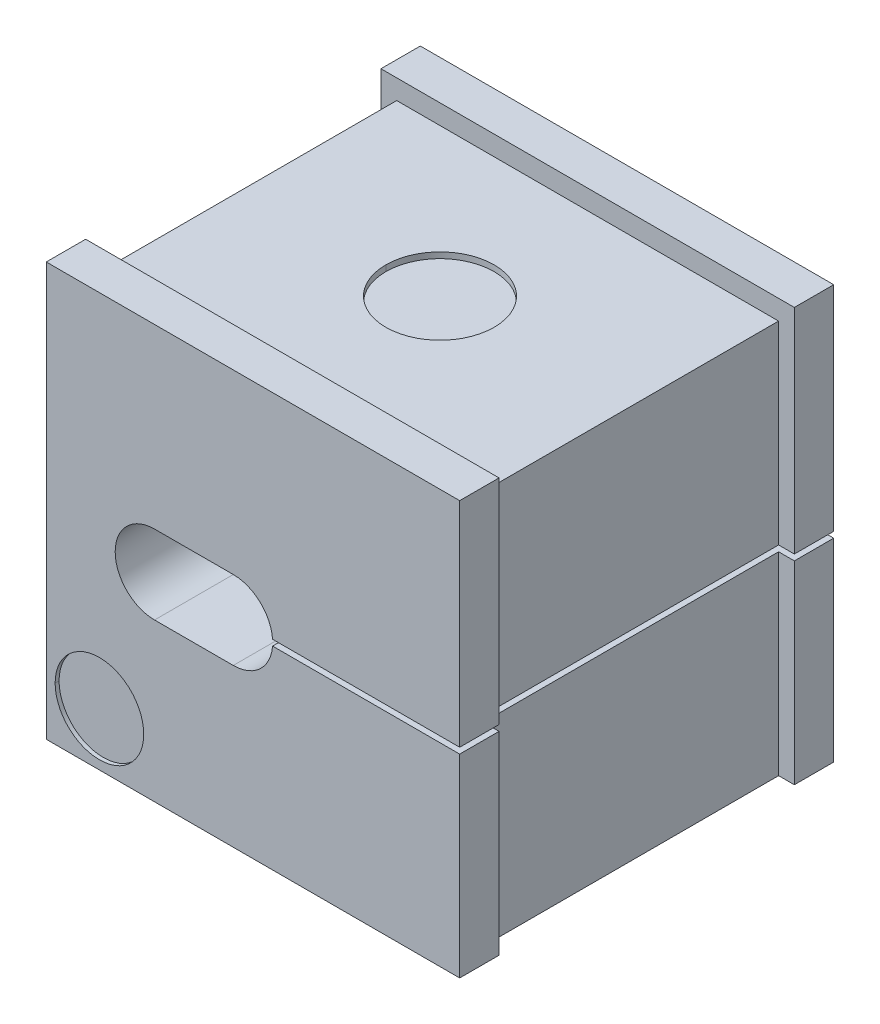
ISO-10303-21;
HEADER;
FILE_DESCRIPTION(('STEP AP214'),'2;1');
FILE_NAME('part.step','',(''),(''),'','','');
FILE_SCHEMA(('AUTOMOTIVE_DESIGN { 1 0 10303 214 1 1 1 1 }'));
ENDSEC;
DATA;
#1=APPLICATION_CONTEXT('core data for automotive mechanical design processes');
#2=APPLICATION_PROTOCOL_DEFINITION('international standard','automotive_design',2000,#1);
#3=PRODUCT_CONTEXT('',#1,'mechanical');
#4=PRODUCT('Part','Part','',(#3));
#5=PRODUCT_RELATED_PRODUCT_CATEGORY('part','',(#4));
#6=PRODUCT_DEFINITION_FORMATION('','',#4);
#7=PRODUCT_DEFINITION_CONTEXT('part definition',#1,'design');
#8=PRODUCT_DEFINITION('design','',#6,#7);
#9=PRODUCT_DEFINITION_SHAPE('','',#8);
#10=(LENGTH_UNIT() NAMED_UNIT(*) SI_UNIT(.MILLI.,.METRE.));
#11=(NAMED_UNIT(*) PLANE_ANGLE_UNIT() SI_UNIT($,.RADIAN.));
#12=(NAMED_UNIT(*) SI_UNIT($,.STERADIAN.) SOLID_ANGLE_UNIT());
#13=UNCERTAINTY_MEASURE_WITH_UNIT(LENGTH_MEASURE(1.E-05),#10,'distance_accuracy_value','');
#14=(GEOMETRIC_REPRESENTATION_CONTEXT(3) GLOBAL_UNCERTAINTY_ASSIGNED_CONTEXT((#13)) GLOBAL_UNIT_ASSIGNED_CONTEXT((#10,
#11,#12)) REPRESENTATION_CONTEXT('',''));
#15=CARTESIAN_POINT('',(0.,0.,0.));
#16=DIRECTION('',(0.,0.,1.));
#17=DIRECTION('',(1.,0.,0.));
#18=AXIS2_PLACEMENT_3D('',#15,#16,#17);
#19=CARTESIAN_POINT('',(0.,-0.35,-9.5));
#20=DIRECTION('',(0.,-1.,0.));
#21=DIRECTION('',(-1.,0.,0.));
#22=AXIS2_PLACEMENT_3D('',#19,#20,#21);
#23=PLANE('',#22);
#24=DIRECTION('',(-1.,0.,0.));
#25=VECTOR('',#24,1.);
#26=CARTESIAN_POINT('',(0.,-0.35,-7.5));
#27=LINE('',#26,#25);
#28=CARTESIAN_POINT('',(21.,-0.35,-7.5));
#29=VERTEX_POINT('',#28);
#30=CARTESIAN_POINT('',(20.2,-0.35,-7.5));
#31=VERTEX_POINT('',#30);
#32=EDGE_CURVE('E377',#29,#31,#27,.T.);
#33=ORIENTED_EDGE('',*,*,#32,.T.);
#34=DIRECTION('',(0.,0.,-1.));
#35=VECTOR('',#34,1.);
#36=CARTESIAN_POINT('',(20.2,-0.35,-5.5));
#37=LINE('',#36,#35);
#38=CARTESIAN_POINT('',(20.2,-0.35,7.5));
#39=VERTEX_POINT('',#38);
#40=EDGE_CURVE('E292',#39,#31,#37,.T.);
#41=ORIENTED_EDGE('',*,*,#40,.F.);
#42=DIRECTION('',(1.,0.,0.));
#43=VECTOR('',#42,1.);
#44=CARTESIAN_POINT('',(1.3,-0.35,7.5));
#45=LINE('',#44,#43);
#46=CARTESIAN_POINT('',(21.,-0.35,7.5));
#47=VERTEX_POINT('',#46);
#48=EDGE_CURVE('E514',#39,#47,#45,.T.);
#49=ORIENTED_EDGE('',*,*,#48,.T.);
#50=DIRECTION('',(0.,0.,1.));
#51=VECTOR('',#50,1.);
#52=CARTESIAN_POINT('',(21.,-0.35,-9.5));
#53=LINE('',#52,#51);
#54=CARTESIAN_POINT('',(21.,-0.35,9.5));
#55=VERTEX_POINT('',#54);
#56=EDGE_CURVE('E480',#47,#55,#53,.T.);
#57=ORIENTED_EDGE('',*,*,#56,.T.);
#58=DIRECTION('',(1.,0.,0.));
#59=VECTOR('',#58,1.);
#60=CARTESIAN_POINT('',(0.,-0.35,9.5));
#61=LINE('',#60,#59);
#62=CARTESIAN_POINT('',(11.4943670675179,-0.35,9.5));
#63=VERTEX_POINT('',#62);
#64=EDGE_CURVE('E322',#63,#55,#61,.T.);
#65=ORIENTED_EDGE('',*,*,#64,.F.);
#66=DIRECTION('',(0.,0.,1.));
#67=VECTOR('',#66,1.);
#68=CARTESIAN_POINT('',(11.4943670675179,-0.35,-9.5));
#69=LINE('',#68,#67);
#70=CARTESIAN_POINT('',(11.4943670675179,-0.35,-9.5));
#71=VERTEX_POINT('',#70);
#72=EDGE_CURVE('E303',#71,#63,#69,.T.);
#73=ORIENTED_EDGE('',*,*,#72,.F.);
#74=DIRECTION('',(1.,0.,0.));
#75=VECTOR('',#74,1.);
#76=CARTESIAN_POINT('',(0.,-0.35,-9.5));
#77=LINE('',#76,#75);
#78=CARTESIAN_POINT('',(21.,-0.35,-9.5));
#79=VERTEX_POINT('',#78);
#80=EDGE_CURVE('E399',#71,#79,#77,.T.);
#81=ORIENTED_EDGE('',*,*,#80,.T.);
#82=DIRECTION('',(0.,0.,1.));
#83=VECTOR('',#82,1.);
#84=CARTESIAN_POINT('',(21.,-0.35,-9.5));
#85=LINE('',#84,#83);
#86=EDGE_CURVE('E469',#79,#29,#85,.T.);
#87=ORIENTED_EDGE('',*,*,#86,.T.);
#88=EDGE_LOOP('',(#33,#41,#49,#57,#65,#73,#81,#87));
#89=FACE_BOUND('',#88,.T.);
#90=ADVANCED_FACE('F15',(#89),#23,.T.);
#91=CARTESIAN_POINT('',(0.,-0.65,-9.5));
#92=DIRECTION('',(0.,-1.,0.));
#93=DIRECTION('',(-1.,0.,0.));
#94=AXIS2_PLACEMENT_3D('',#91,#92,#93);
#95=PLANE('',#94);
#96=DIRECTION('',(0.,0.,1.));
#97=VECTOR('',#96,1.);
#98=CARTESIAN_POINT('',(21.,-0.65,-9.5));
#99=LINE('',#98,#97);
#100=CARTESIAN_POINT('',(21.,-0.65,-9.5));
#101=VERTEX_POINT('',#100);
#102=CARTESIAN_POINT('',(21.,-0.65,-7.5));
#103=VERTEX_POINT('',#102);
#104=EDGE_CURVE('E555',#101,#103,#99,.T.);
#105=ORIENTED_EDGE('',*,*,#104,.F.);
#106=DIRECTION('',(1.,0.,0.));
#107=VECTOR('',#106,1.);
#108=CARTESIAN_POINT('',(0.,-0.65,-9.5));
#109=LINE('',#108,#107);
#110=CARTESIAN_POINT('',(11.4943670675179,-0.65,-9.5));
#111=VERTEX_POINT('',#110);
#112=EDGE_CURVE('E427',#111,#101,#109,.T.);
#113=ORIENTED_EDGE('',*,*,#112,.F.);
#114=DIRECTION('',(0.,0.,1.));
#115=VECTOR('',#114,1.);
#116=CARTESIAN_POINT('',(11.4943670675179,-0.65,-9.5));
#117=LINE('',#116,#115);
#118=CARTESIAN_POINT('',(11.4943670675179,-0.65,9.5));
#119=VERTEX_POINT('',#118);
#120=EDGE_CURVE('E270',#111,#119,#117,.T.);
#121=ORIENTED_EDGE('',*,*,#120,.T.);
#122=DIRECTION('',(1.,0.,0.));
#123=VECTOR('',#122,1.);
#124=CARTESIAN_POINT('',(0.,-0.65,9.5));
#125=LINE('',#124,#123);
#126=CARTESIAN_POINT('',(21.,-0.65,9.5));
#127=VERTEX_POINT('',#126);
#128=EDGE_CURVE('E311',#119,#127,#125,.T.);
#129=ORIENTED_EDGE('',*,*,#128,.T.);
#130=DIRECTION('',(0.,0.,1.));
#131=VECTOR('',#130,1.);
#132=CARTESIAN_POINT('',(21.,-0.65,-9.5));
#133=LINE('',#132,#131);
#134=CARTESIAN_POINT('',(21.,-0.65,7.5));
#135=VERTEX_POINT('',#134);
#136=EDGE_CURVE('E493',#135,#127,#133,.T.);
#137=ORIENTED_EDGE('',*,*,#136,.F.);
#138=DIRECTION('',(1.,0.,0.));
#139=VECTOR('',#138,1.);
#140=CARTESIAN_POINT('',(1.3,-0.65,7.5));
#141=LINE('',#140,#139);
#142=CARTESIAN_POINT('',(20.2,-0.65,7.5));
#143=VERTEX_POINT('',#142);
#144=EDGE_CURVE('E36',#143,#135,#141,.T.);
#145=ORIENTED_EDGE('',*,*,#144,.F.);
#146=DIRECTION('',(0.,0.,-1.));
#147=VECTOR('',#146,1.);
#148=CARTESIAN_POINT('',(20.2,-0.65,-5.5));
#149=LINE('',#148,#147);
#150=CARTESIAN_POINT('',(20.2,-0.65,-7.5));
#151=VERTEX_POINT('',#150);
#152=EDGE_CURVE('E439',#143,#151,#149,.T.);
#153=ORIENTED_EDGE('',*,*,#152,.T.);
#154=DIRECTION('',(-1.,0.,0.));
#155=VECTOR('',#154,1.);
#156=CARTESIAN_POINT('',(0.,-0.65,-7.5));
#157=LINE('',#156,#155);
#158=EDGE_CURVE('E46',#103,#151,#157,.T.);
#159=ORIENTED_EDGE('',*,*,#158,.F.);
#160=EDGE_LOOP('',(#105,#113,#121,#129,#137,#145,#153,#159));
#161=FACE_BOUND('',#160,.T.);
#162=ADVANCED_FACE('F573',(#161),#95,.F.);
#163=CARTESIAN_POINT('',(9.5,1.5,-9.5));
#164=DIRECTION('',(0.,-1.,0.));
#165=DIRECTION('',(0.,0.,-1.));
#166=AXIS2_PLACEMENT_3D('',#163,#164,#165);
#167=PLANE('',#166);
#168=DIRECTION('',(1.,0.,0.));
#169=VECTOR('',#168,1.);
#170=CARTESIAN_POINT('',(9.5,1.5,9.5));
#171=LINE('',#170,#169);
#172=CARTESIAN_POINT('',(5.5,1.5,9.5));
#173=VERTEX_POINT('',#172);
#174=CARTESIAN_POINT('',(9.5,1.5,9.5));
#175=VERTEX_POINT('',#174);
#176=EDGE_CURVE('E385',#173,#175,#171,.T.);
#177=ORIENTED_EDGE('',*,*,#176,.F.);
#178=DIRECTION('',(0.,0.,1.));
#179=VECTOR('',#178,1.);
#180=CARTESIAN_POINT('',(5.5,1.5,-9.5));
#181=LINE('',#180,#179);
#182=CARTESIAN_POINT('',(5.5,1.5,-9.5));
#183=VERTEX_POINT('',#182);
#184=EDGE_CURVE('E9',#183,#173,#181,.T.);
#185=ORIENTED_EDGE('',*,*,#184,.F.);
#186=DIRECTION('',(1.,0.,0.));
#187=VECTOR('',#186,1.);
#188=CARTESIAN_POINT('',(9.5,1.5,-9.5));
#189=LINE('',#188,#187);
#190=CARTESIAN_POINT('',(9.5,1.5,-9.5));
#191=VERTEX_POINT('',#190);
#192=EDGE_CURVE('E409',#183,#191,#189,.T.);
#193=ORIENTED_EDGE('',*,*,#192,.T.);
#194=DIRECTION('',(0.,0.,1.));
#195=VECTOR('',#194,1.);
#196=CARTESIAN_POINT('',(9.5,1.5,-9.5));
#197=LINE('',#196,#195);
#198=EDGE_CURVE('E306',#191,#175,#197,.T.);
#199=ORIENTED_EDGE('',*,*,#198,.T.);
#200=EDGE_LOOP('',(#177,#185,#193,#199));
#201=FACE_BOUND('',#200,.T.);
#202=ADVANCED_FACE('F641',(#201),#167,.T.);
#203=CARTESIAN_POINT('',(5.5,-0.5,-9.5));
#204=DIRECTION('',(0.,0.,1.));
#205=DIRECTION('',(1.,0.,0.));
#206=AXIS2_PLACEMENT_3D('',#203,#204,#205);
#207=CYLINDRICAL_SURFACE('',#206,2.);
#208=CARTESIAN_POINT('',(5.5,-0.5,9.5));
#209=DIRECTION('',(0.,0.,-1.));
#210=DIRECTION('',(-1.,0.,0.));
#211=AXIS2_PLACEMENT_3D('',#208,#209,#210);
#212=CIRCLE('',#211,2.);
#213=CARTESIAN_POINT('',(5.5,-2.5,9.5));
#214=VERTEX_POINT('',#213);
#215=EDGE_CURVE('E376',#214,#173,#212,.T.);
#216=ORIENTED_EDGE('',*,*,#215,.F.);
#217=DIRECTION('',(0.,0.,1.));
#218=VECTOR('',#217,1.);
#219=CARTESIAN_POINT('',(5.5,-2.5,-9.5));
#220=LINE('',#219,#218);
#221=CARTESIAN_POINT('',(5.5,-2.5,-9.5));
#222=VERTEX_POINT('',#221);
#223=EDGE_CURVE('E24',#222,#214,#220,.T.);
#224=ORIENTED_EDGE('',*,*,#223,.F.);
#225=CARTESIAN_POINT('',(5.5,-0.5,-9.5));
#226=DIRECTION('',(0.,0.,-1.));
#227=DIRECTION('',(-1.,0.,0.));
#228=AXIS2_PLACEMENT_3D('',#225,#226,#227);
#229=CIRCLE('',#228,2.);
#230=EDGE_CURVE('E413',#222,#183,#229,.T.);
#231=ORIENTED_EDGE('',*,*,#230,.T.);
#232=ORIENTED_EDGE('',*,*,#184,.T.);
#233=EDGE_LOOP('',(#216,#224,#231,#232));
#234=FACE_BOUND('',#233,.T.);
#235=ADVANCED_FACE('F644',(#234),#207,.F.);
#236=CARTESIAN_POINT('',(9.5,-2.5,-9.5));
#237=DIRECTION('',(0.,1.,0.));
#238=DIRECTION('',(1.,0.,0.));
#239=AXIS2_PLACEMENT_3D('',#236,#237,#238);
#240=PLANE('',#239);
#241=DIRECTION('',(-1.,0.,0.));
#242=VECTOR('',#241,1.);
#243=CARTESIAN_POINT('',(9.5,-2.5,9.5));
#244=LINE('',#243,#242);
#245=CARTESIAN_POINT('',(9.5,-2.5,9.5));
#246=VERTEX_POINT('',#245);
#247=EDGE_CURVE('E369',#246,#214,#244,.T.);
#248=ORIENTED_EDGE('',*,*,#247,.F.);
#249=DIRECTION('',(0.,0.,1.));
#250=VECTOR('',#249,1.);
#251=CARTESIAN_POINT('',(9.5,-2.5,-9.5));
#252=LINE('',#251,#250);
#253=CARTESIAN_POINT('',(9.5,-2.5,-9.5));
#254=VERTEX_POINT('',#253);
#255=EDGE_CURVE('E18',#254,#246,#252,.T.);
#256=ORIENTED_EDGE('',*,*,#255,.F.);
#257=DIRECTION('',(-1.,0.,0.));
#258=VECTOR('',#257,1.);
#259=CARTESIAN_POINT('',(9.5,-2.5,-9.5));
#260=LINE('',#259,#258);
#261=EDGE_CURVE('E419',#254,#222,#260,.T.);
#262=ORIENTED_EDGE('',*,*,#261,.T.);
#263=ORIENTED_EDGE('',*,*,#223,.T.);
#264=EDGE_LOOP('',(#248,#256,#262,#263));
#265=FACE_BOUND('',#264,.T.);
#266=ADVANCED_FACE('F646',(#265),#240,.T.);
#267=CARTESIAN_POINT('',(9.5,-0.5,-9.5));
#268=DIRECTION('',(0.,0.,1.));
#269=DIRECTION('',(1.,0.,0.));
#270=AXIS2_PLACEMENT_3D('',#267,#268,#269);
#271=CYLINDRICAL_SURFACE('',#270,2.);
#272=ORIENTED_EDGE('',*,*,#120,.F.);
#273=CARTESIAN_POINT('',(9.5,-0.5,-9.5));
#274=DIRECTION('',(0.,0.,-1.));
#275=DIRECTION('',(-1.,0.,0.));
#276=AXIS2_PLACEMENT_3D('',#273,#274,#275);
#277=CIRCLE('',#276,2.);
#278=EDGE_CURVE('E423',#111,#254,#277,.T.);
#279=ORIENTED_EDGE('',*,*,#278,.T.);
#280=ORIENTED_EDGE('',*,*,#255,.T.);
#281=CARTESIAN_POINT('',(9.5,-0.5,9.5));
#282=DIRECTION('',(0.,0.,-1.));
#283=DIRECTION('',(-1.,0.,0.));
#284=AXIS2_PLACEMENT_3D('',#281,#282,#283);
#285=CIRCLE('',#284,2.);
#286=EDGE_CURVE('E328',#119,#246,#285,.T.);
#287=ORIENTED_EDGE('',*,*,#286,.F.);
#288=EDGE_LOOP('',(#272,#279,#280,#287));
#289=FACE_BOUND('',#288,.T.);
#290=ADVANCED_FACE('F592',(#289),#271,.F.);
#291=CARTESIAN_POINT('',(2.7,-7.8,9.3));
#292=DIRECTION('',(0.,0.,1.));
#293=DIRECTION('',(1.,0.,0.));
#294=AXIS2_PLACEMENT_3D('',#291,#292,#293);
#295=PLANE('',#294);
#296=CARTESIAN_POINT('',(2.7,-7.8,9.3));
#297=DIRECTION('',(0.,0.,1.));
#298=DIRECTION('',(1.,0.,0.));
#299=AXIS2_PLACEMENT_3D('',#296,#297,#298);
#300=CIRCLE('',#299,2.25);
#301=CARTESIAN_POINT('',(4.95,-7.8,9.3));
#302=VERTEX_POINT('',#301);
#303=CARTESIAN_POINT('',(0.45,-7.8,9.3));
#304=VERTEX_POINT('',#303);
#305=EDGE_CURVE('E261',#302,#304,#300,.T.);
#306=ORIENTED_EDGE('',*,*,#305,.T.);
#307=CARTESIAN_POINT('',(2.7,-7.8,9.3));
#308=DIRECTION('',(0.,0.,1.));
#309=DIRECTION('',(1.,0.,0.));
#310=AXIS2_PLACEMENT_3D('',#307,#308,#309);
#311=CIRCLE('',#310,2.25);
#312=EDGE_CURVE('E265',#304,#302,#311,.T.);
#313=ORIENTED_EDGE('',*,*,#312,.T.);
#314=EDGE_LOOP('',(#306,#313));
#315=FACE_BOUND('',#314,.T.);
#316=ADVANCED_FACE('F263',(#315),#295,.T.);
#317=CARTESIAN_POINT('',(2.7,-7.8,9.3));
#318=DIRECTION('',(0.,0.,1.));
#319=DIRECTION('',(1.,0.,0.));
#320=AXIS2_PLACEMENT_3D('',#317,#318,#319);
#321=CYLINDRICAL_SURFACE('',#320,2.25);
#322=DIRECTION('',(0.,0.,1.));
#323=VECTOR('',#322,1.);
#324=CARTESIAN_POINT('',(0.45,-7.8,9.3));
#325=LINE('',#324,#323);
#326=CARTESIAN_POINT('',(0.45,-7.8,9.5));
#327=VERTEX_POINT('',#326);
#328=EDGE_CURVE('E274',#304,#327,#325,.T.);
#329=ORIENTED_EDGE('',*,*,#328,.F.);
#330=ORIENTED_EDGE('',*,*,#305,.F.);
#331=DIRECTION('',(0.,0.,1.));
#332=VECTOR('',#331,1.);
#333=CARTESIAN_POINT('',(4.95,-7.8,9.3));
#334=LINE('',#333,#332);
#335=CARTESIAN_POINT('',(4.95,-7.8,9.5));
#336=VERTEX_POINT('',#335);
#337=EDGE_CURVE('E284',#302,#336,#334,.T.);
#338=ORIENTED_EDGE('',*,*,#337,.T.);
#339=CARTESIAN_POINT('',(2.7,-7.8,9.5));
#340=DIRECTION('',(0.,0.,1.));
#341=DIRECTION('',(1.,0.,0.));
#342=AXIS2_PLACEMENT_3D('',#339,#340,#341);
#343=CIRCLE('',#342,2.25);
#344=EDGE_CURVE('E276',#336,#327,#343,.T.);
#345=ORIENTED_EDGE('',*,*,#344,.T.);
#346=EDGE_LOOP('',(#329,#330,#338,#345));
#347=FACE_BOUND('',#346,.T.);
#348=ADVANCED_FACE('F275',(#347),#321,.F.);
#349=CARTESIAN_POINT('',(10.5,9.2,0.));
#350=DIRECTION('',(0.,1.,0.));
#351=DIRECTION('',(-1.,0.,0.));
#352=AXIS2_PLACEMENT_3D('',#349,#350,#351);
#353=CYLINDRICAL_SURFACE('',#352,2.75);
#354=DIRECTION('',(0.,1.,0.));
#355=VECTOR('',#354,1.);
#356=CARTESIAN_POINT('',(13.25,9.2,0.));
#357=LINE('',#356,#355);
#358=CARTESIAN_POINT('',(13.25,9.2,0.));
#359=VERTEX_POINT('',#358);
#360=CARTESIAN_POINT('',(13.25,9.5,0.));
#361=VERTEX_POINT('',#360);
#362=EDGE_CURVE('E344',#359,#361,#357,.T.);
#363=ORIENTED_EDGE('',*,*,#362,.F.);
#364=CARTESIAN_POINT('',(10.5,9.2,0.));
#365=DIRECTION('',(0.,1.,0.));
#366=DIRECTION('',(-1.,0.,0.));
#367=AXIS2_PLACEMENT_3D('',#364,#365,#366);
#368=CIRCLE('',#367,2.75);
#369=CARTESIAN_POINT('',(7.75,9.2,0.));
#370=VERTEX_POINT('',#369);
#371=EDGE_CURVE('E271',#370,#359,#368,.T.);
#372=ORIENTED_EDGE('',*,*,#371,.F.);
#373=DIRECTION('',(0.,1.,0.));
#374=VECTOR('',#373,1.);
#375=CARTESIAN_POINT('',(7.75,9.2,0.));
#376=LINE('',#375,#374);
#377=CARTESIAN_POINT('',(7.75,9.5,0.));
#378=VERTEX_POINT('',#377);
#379=EDGE_CURVE('E357',#370,#378,#376,.T.);
#380=ORIENTED_EDGE('',*,*,#379,.T.);
#381=CARTESIAN_POINT('',(10.5,9.5,0.));
#382=DIRECTION('',(0.,-1.,0.));
#383=DIRECTION('',(1.,0.,0.));
#384=AXIS2_PLACEMENT_3D('',#381,#382,#383);
#385=CIRCLE('',#384,2.75);
#386=EDGE_CURVE('E298',#361,#378,#385,.T.);
#387=ORIENTED_EDGE('',*,*,#386,.F.);
#388=EDGE_LOOP('',(#363,#372,#380,#387));
#389=FACE_BOUND('',#388,.T.);
#390=ADVANCED_FACE('F793',(#389),#353,.F.);
#391=CARTESIAN_POINT('',(10.5,9.2,0.));
#392=DIRECTION('',(0.,1.,0.));
#393=DIRECTION('',(1.,0.,0.));
#394=AXIS2_PLACEMENT_3D('',#391,#392,#393);
#395=PLANE('',#394);
#396=ORIENTED_EDGE('',*,*,#371,.T.);
#397=CARTESIAN_POINT('',(10.5,9.2,0.));
#398=DIRECTION('',(0.,1.,0.));
#399=DIRECTION('',(-1.,0.,0.));
#400=AXIS2_PLACEMENT_3D('',#397,#398,#399);
#401=CIRCLE('',#400,2.75);
#402=EDGE_CURVE('E334',#359,#370,#401,.T.);
#403=ORIENTED_EDGE('',*,*,#402,.T.);
#404=EDGE_LOOP('',(#396,#403));
#405=FACE_BOUND('',#404,.T.);
#406=ADVANCED_FACE('F788',(#405),#395,.T.);
#407=CARTESIAN_POINT('',(1.3,0.,7.5));
#408=DIRECTION('',(0.,0.,1.));
#409=DIRECTION('',(1.,0.,0.));
#410=AXIS2_PLACEMENT_3D('',#407,#408,#409);
#411=PLANE('',#410);
#412=DIRECTION('',(0.,-1.,0.));
#413=VECTOR('',#412,1.);
#414=CARTESIAN_POINT('',(20.2,9.5,7.5));
#415=LINE('',#414,#413);
#416=CARTESIAN_POINT('',(20.2,-10.5,7.5));
#417=VERTEX_POINT('',#416);
#418=EDGE_CURVE('E442',#143,#417,#415,.T.);
#419=ORIENTED_EDGE('',*,*,#418,.F.);
#420=ORIENTED_EDGE('',*,*,#144,.T.);
#421=DIRECTION('',(0.,1.,0.));
#422=VECTOR('',#421,1.);
#423=CARTESIAN_POINT('',(21.,-10.5,7.5));
#424=LINE('',#423,#422);
#425=CARTESIAN_POINT('',(21.,-10.5,7.5));
#426=VERTEX_POINT('',#425);
#427=EDGE_CURVE('E490',#426,#135,#424,.T.);
#428=ORIENTED_EDGE('',*,*,#427,.F.);
#429=DIRECTION('',(-1.,0.,0.));
#430=VECTOR('',#429,1.);
#431=CARTESIAN_POINT('',(19.7,-10.5,7.5));
#432=LINE('',#431,#430);
#433=EDGE_CURVE('E345',#426,#417,#432,.T.);
#434=ORIENTED_EDGE('',*,*,#433,.T.);
#435=EDGE_LOOP('',(#419,#420,#428,#434));
#436=FACE_BOUND('',#435,.T.);
#437=ADVANCED_FACE('F575',(#436),#411,.F.);
#438=CARTESIAN_POINT('',(0.,0.,-7.5));
#439=DIRECTION('',(0.,0.,-1.));
#440=DIRECTION('',(-1.,0.,0.));
#441=AXIS2_PLACEMENT_3D('',#438,#439,#440);
#442=PLANE('',#441);
#443=DIRECTION('',(0.,1.,0.));
#444=VECTOR('',#443,1.);
#445=CARTESIAN_POINT('',(21.,-10.5,-7.5));
#446=LINE('',#445,#444);
#447=CARTESIAN_POINT('',(21.,-10.5,-7.5));
#448=VERTEX_POINT('',#447);
#449=EDGE_CURVE('E559',#448,#103,#446,.T.);
#450=ORIENTED_EDGE('',*,*,#449,.T.);
#451=ORIENTED_EDGE('',*,*,#158,.T.);
#452=DIRECTION('',(0.,1.,0.));
#453=VECTOR('',#452,1.);
#454=CARTESIAN_POINT('',(20.2,9.5,-7.5));
#455=LINE('',#454,#453);
#456=CARTESIAN_POINT('',(20.2,-10.5,-7.5));
#457=VERTEX_POINT('',#456);
#458=EDGE_CURVE('E451',#457,#151,#455,.T.);
#459=ORIENTED_EDGE('',*,*,#458,.F.);
#460=DIRECTION('',(1.,0.,0.));
#461=VECTOR('',#460,1.);
#462=CARTESIAN_POINT('',(21.,-10.5,-7.5));
#463=LINE('',#462,#461);
#464=EDGE_CURVE('E349',#457,#448,#463,.T.);
#465=ORIENTED_EDGE('',*,*,#464,.T.);
#466=EDGE_LOOP('',(#450,#451,#459,#465));
#467=FACE_BOUND('',#466,.T.);
#468=ADVANCED_FACE('F568',(#467),#442,.F.);
#469=CARTESIAN_POINT('',(0.8,0.,1.75));
#470=DIRECTION('',(1.,0.,0.));
#471=DIRECTION('',(0.,0.,-1.));
#472=AXIS2_PLACEMENT_3D('',#469,#470,#471);
#473=PLANE('',#472);
#474=DIRECTION('',(0.,0.,-1.));
#475=VECTOR('',#474,1.);
#476=CARTESIAN_POINT('',(0.8,-10.5,1.75));
#477=LINE('',#476,#475);
#478=CARTESIAN_POINT('',(0.8,-10.5,7.5));
#479=VERTEX_POINT('',#478);
#480=CARTESIAN_POINT('',(0.8,-10.5,-7.5));
#481=VERTEX_POINT('',#480);
#482=EDGE_CURVE('E316',#479,#481,#477,.T.);
#483=ORIENTED_EDGE('',*,*,#482,.F.);
#484=DIRECTION('',(0.,1.,0.));
#485=VECTOR('',#484,1.);
#486=CARTESIAN_POINT('',(0.8,9.5,7.5));
#487=LINE('',#486,#485);
#488=CARTESIAN_POINT('',(0.8,9.5,7.5));
#489=VERTEX_POINT('',#488);
#490=EDGE_CURVE('E521',#479,#489,#487,.T.);
#491=ORIENTED_EDGE('',*,*,#490,.T.);
#492=DIRECTION('',(0.,0.,-1.));
#493=VECTOR('',#492,1.);
#494=CARTESIAN_POINT('',(0.8,9.5,1.75));
#495=LINE('',#494,#493);
#496=CARTESIAN_POINT('',(0.8,9.5,-7.5));
#497=VERTEX_POINT('',#496);
#498=EDGE_CURVE('E301',#489,#497,#495,.T.);
#499=ORIENTED_EDGE('',*,*,#498,.T.);
#500=DIRECTION('',(0.,-1.,0.));
#501=VECTOR('',#500,1.);
#502=CARTESIAN_POINT('',(0.8,9.5,-7.5));
#503=LINE('',#502,#501);
#504=EDGE_CURVE('E505',#497,#481,#503,.T.);
#505=ORIENTED_EDGE('',*,*,#504,.T.);
#506=EDGE_LOOP('',(#483,#491,#499,#505));
#507=FACE_BOUND('',#506,.T.);
#508=ADVANCED_FACE('F617',(#507),#473,.F.);
#509=CARTESIAN_POINT('',(0.,0.,9.5));
#510=DIRECTION('',(1.,0.,0.));
#511=DIRECTION('',(0.,1.,0.));
#512=AXIS2_PLACEMENT_3D('',#509,#510,#511);
#513=PLANE('',#512);
#514=DIRECTION('',(0.,0.,-1.));
#515=VECTOR('',#514,1.);
#516=CARTESIAN_POINT('',(0.,-10.5,9.5));
#517=LINE('',#516,#515);
#518=CARTESIAN_POINT('',(0.,-10.5,-7.5));
#519=VERTEX_POINT('',#518);
#520=CARTESIAN_POINT('',(0.,-10.5,-9.5));
#521=VERTEX_POINT('',#520);
#522=EDGE_CURVE('E312',#519,#521,#517,.T.);
#523=ORIENTED_EDGE('',*,*,#522,.F.);
#524=DIRECTION('',(0.,1.,0.));
#525=VECTOR('',#524,1.);
#526=CARTESIAN_POINT('',(0.,0.,-7.5));
#527=LINE('',#526,#525);
#528=CARTESIAN_POINT('',(0.,10.5,-7.5));
#529=VERTEX_POINT('',#528);
#530=EDGE_CURVE('E497',#519,#529,#527,.T.);
#531=ORIENTED_EDGE('',*,*,#530,.T.);
#532=DIRECTION('',(0.,0.,-1.));
#533=VECTOR('',#532,1.);
#534=CARTESIAN_POINT('',(0.,10.5,9.5));
#535=LINE('',#534,#533);
#536=CARTESIAN_POINT('',(0.,10.5,-9.5));
#537=VERTEX_POINT('',#536);
#538=EDGE_CURVE('E443',#529,#537,#535,.T.);
#539=ORIENTED_EDGE('',*,*,#538,.T.);
#540=DIRECTION('',(0.,-1.,0.));
#541=VECTOR('',#540,1.);
#542=CARTESIAN_POINT('',(0.,0.,-9.5));
#543=LINE('',#542,#541);
#544=EDGE_CURVE('E340',#537,#521,#543,.T.);
#545=ORIENTED_EDGE('',*,*,#544,.T.);
#546=EDGE_LOOP('',(#523,#531,#539,#545));
#547=FACE_BOUND('',#546,.T.);
#548=ADVANCED_FACE('F622',(#547),#513,.F.);
#549=CARTESIAN_POINT('',(0.,0.,9.5));
#550=DIRECTION('',(1.,0.,0.));
#551=DIRECTION('',(0.,1.,0.));
#552=AXIS2_PLACEMENT_3D('',#549,#550,#551);
#553=PLANE('',#552);
#554=DIRECTION('',(0.,1.,0.));
#555=VECTOR('',#554,1.);
#556=CARTESIAN_POINT('',(0.,0.,7.5));
#557=LINE('',#556,#555);
#558=CARTESIAN_POINT('',(0.,-10.5,7.5));
#559=VERTEX_POINT('',#558);
#560=CARTESIAN_POINT('',(0.,10.5,7.5));
#561=VERTEX_POINT('',#560);
#562=EDGE_CURVE('E530',#559,#561,#557,.T.);
#563=ORIENTED_EDGE('',*,*,#562,.F.);
#564=DIRECTION('',(0.,0.,-1.));
#565=VECTOR('',#564,1.);
#566=CARTESIAN_POINT('',(0.,-10.5,9.5));
#567=LINE('',#566,#565);
#568=CARTESIAN_POINT('',(0.,-10.5,9.5));
#569=VERTEX_POINT('',#568);
#570=EDGE_CURVE('E477',#569,#559,#567,.T.);
#571=ORIENTED_EDGE('',*,*,#570,.F.);
#572=DIRECTION('',(0.,-1.,0.));
#573=VECTOR('',#572,1.);
#574=CARTESIAN_POINT('',(0.,0.,9.5));
#575=LINE('',#574,#573);
#576=CARTESIAN_POINT('',(0.,10.5,9.5));
#577=VERTEX_POINT('',#576);
#578=EDGE_CURVE('E297',#577,#569,#575,.T.);
#579=ORIENTED_EDGE('',*,*,#578,.F.);
#580=DIRECTION('',(0.,0.,-1.));
#581=VECTOR('',#580,1.);
#582=CARTESIAN_POINT('',(0.,10.5,9.5));
#583=LINE('',#582,#581);
#584=EDGE_CURVE('E300',#577,#561,#583,.T.);
#585=ORIENTED_EDGE('',*,*,#584,.T.);
#586=EDGE_LOOP('',(#563,#571,#579,#585));
#587=FACE_BOUND('',#586,.T.);
#588=ADVANCED_FACE('F606',(#587),#553,.F.);
#589=CARTESIAN_POINT('',(21.,0.,9.5));
#590=DIRECTION('',(1.,0.,0.));
#591=DIRECTION('',(0.,1.,0.));
#592=AXIS2_PLACEMENT_3D('',#589,#590,#591);
#593=PLANE('',#592);
#594=ORIENTED_EDGE('',*,*,#136,.T.);
#595=DIRECTION('',(0.,-1.,0.));
#596=VECTOR('',#595,1.);
#597=CARTESIAN_POINT('',(21.,0.,9.5));
#598=LINE('',#597,#596);
#599=CARTESIAN_POINT('',(21.,-10.5,9.5));
#600=VERTEX_POINT('',#599);
#601=EDGE_CURVE('E296',#127,#600,#598,.T.);
#602=ORIENTED_EDGE('',*,*,#601,.T.);
#603=DIRECTION('',(0.,0.,-1.));
#604=VECTOR('',#603,1.);
#605=CARTESIAN_POINT('',(21.,-10.5,9.5));
#606=LINE('',#605,#604);
#607=EDGE_CURVE('E348',#600,#426,#606,.T.);
#608=ORIENTED_EDGE('',*,*,#607,.T.);
#609=ORIENTED_EDGE('',*,*,#427,.T.);
#610=EDGE_LOOP('',(#594,#602,#608,#609));
#611=FACE_BOUND('',#610,.T.);
#612=ADVANCED_FACE('F600',(#611),#593,.T.);
#613=CARTESIAN_POINT('',(21.,0.,9.5));
#614=DIRECTION('',(1.,0.,0.));
#615=DIRECTION('',(0.,1.,0.));
#616=AXIS2_PLACEMENT_3D('',#613,#614,#615);
#617=PLANE('',#616);
#618=ORIENTED_EDGE('',*,*,#104,.T.);
#619=ORIENTED_EDGE('',*,*,#449,.F.);
#620=DIRECTION('',(0.,0.,-1.));
#621=VECTOR('',#620,1.);
#622=CARTESIAN_POINT('',(21.,-10.5,9.5));
#623=LINE('',#622,#621);
#624=CARTESIAN_POINT('',(21.,-10.5,-9.5));
#625=VERTEX_POINT('',#624);
#626=EDGE_CURVE('E315',#448,#625,#623,.T.);
#627=ORIENTED_EDGE('',*,*,#626,.T.);
#628=DIRECTION('',(0.,-1.,0.));
#629=VECTOR('',#628,1.);
#630=CARTESIAN_POINT('',(21.,0.,-9.5));
#631=LINE('',#630,#629);
#632=EDGE_CURVE('E431',#101,#625,#631,.T.);
#633=ORIENTED_EDGE('',*,*,#632,.F.);
#634=EDGE_LOOP('',(#618,#619,#627,#633));
#635=FACE_BOUND('',#634,.T.);
#636=ADVANCED_FACE('F583',(#635),#617,.T.);
#637=CARTESIAN_POINT('',(0.,-10.5,9.5));
#638=DIRECTION('',(0.,-1.,0.));
#639=DIRECTION('',(0.,0.,-1.));
#640=AXIS2_PLACEMENT_3D('',#637,#638,#639);
#641=PLANE('',#640);
#642=ORIENTED_EDGE('',*,*,#482,.T.);
#643=DIRECTION('',(-1.,0.,0.));
#644=VECTOR('',#643,1.);
#645=CARTESIAN_POINT('',(0.,-10.5,-7.5));
#646=LINE('',#645,#644);
#647=EDGE_CURVE('E501',#481,#519,#646,.T.);
#648=ORIENTED_EDGE('',*,*,#647,.T.);
#649=ORIENTED_EDGE('',*,*,#522,.T.);
#650=DIRECTION('',(-1.,0.,0.));
#651=VECTOR('',#650,1.);
#652=CARTESIAN_POINT('',(0.,-10.5,-9.5));
#653=LINE('',#652,#651);
#654=EDGE_CURVE('E435',#625,#521,#653,.T.);
#655=ORIENTED_EDGE('',*,*,#654,.F.);
#656=ORIENTED_EDGE('',*,*,#626,.F.);
#657=ORIENTED_EDGE('',*,*,#464,.F.);
#658=DIRECTION('',(0.,0.,-1.));
#659=VECTOR('',#658,1.);
#660=CARTESIAN_POINT('',(20.2,-10.5,1.75));
#661=LINE('',#660,#659);
#662=EDGE_CURVE('E447',#417,#457,#661,.T.);
#663=ORIENTED_EDGE('',*,*,#662,.F.);
#664=ORIENTED_EDGE('',*,*,#433,.F.);
#665=ORIENTED_EDGE('',*,*,#607,.F.);
#666=DIRECTION('',(-1.,0.,0.));
#667=VECTOR('',#666,1.);
#668=CARTESIAN_POINT('',(0.,-10.5,9.5));
#669=LINE('',#668,#667);
#670=EDGE_CURVE('E293',#600,#569,#669,.T.);
#671=ORIENTED_EDGE('',*,*,#670,.T.);
#672=ORIENTED_EDGE('',*,*,#570,.T.);
#673=DIRECTION('',(1.,0.,0.));
#674=VECTOR('',#673,1.);
#675=CARTESIAN_POINT('',(1.3,-10.5,7.5));
#676=LINE('',#675,#674);
#677=EDGE_CURVE('E526',#559,#479,#676,.T.);
#678=ORIENTED_EDGE('',*,*,#677,.T.);
#679=EDGE_LOOP('',(#642,#648,#649,#655,#656,#657,#663,#664,#665,#671,#672,#678));
#680=FACE_BOUND('',#679,.T.);
#681=ADVANCED_FACE('F578',(#680),#641,.T.);
#682=CARTESIAN_POINT('',(20.2,-10.5,-5.5));
#683=DIRECTION('',(1.,0.,0.));
#684=DIRECTION('',(0.,1.,0.));
#685=AXIS2_PLACEMENT_3D('',#682,#683,#684);
#686=PLANE('',#685);
#687=ORIENTED_EDGE('',*,*,#152,.F.);
#688=ORIENTED_EDGE('',*,*,#418,.T.);
#689=ORIENTED_EDGE('',*,*,#662,.T.);
#690=ORIENTED_EDGE('',*,*,#458,.T.);
#691=EDGE_LOOP('',(#687,#688,#689,#690));
#692=FACE_BOUND('',#691,.T.);
#693=ADVANCED_FACE('F571',(#692),#686,.T.);
#694=CARTESIAN_POINT('',(0.,10.5,9.5));
#695=DIRECTION('',(0.,-1.,0.));
#696=DIRECTION('',(0.,0.,-1.));
#697=AXIS2_PLACEMENT_3D('',#694,#695,#696);
#698=PLANE('',#697);
#699=DIRECTION('',(-1.,0.,0.));
#700=VECTOR('',#699,1.);
#701=CARTESIAN_POINT('',(0.,10.5,-7.5));
#702=LINE('',#701,#700);
#703=CARTESIAN_POINT('',(21.,10.5,-7.5));
#704=VERTEX_POINT('',#703);
#705=EDGE_CURVE('E380',#704,#529,#702,.T.);
#706=ORIENTED_EDGE('',*,*,#705,.F.);
#707=DIRECTION('',(0.,0.,-1.));
#708=VECTOR('',#707,1.);
#709=CARTESIAN_POINT('',(21.,10.5,9.5));
#710=LINE('',#709,#708);
#711=CARTESIAN_POINT('',(21.,10.5,-9.5));
#712=VERTEX_POINT('',#711);
#713=EDGE_CURVE('E473',#704,#712,#710,.T.);
#714=ORIENTED_EDGE('',*,*,#713,.T.);
#715=DIRECTION('',(-1.,0.,0.));
#716=VECTOR('',#715,1.);
#717=CARTESIAN_POINT('',(0.,10.5,-9.5));
#718=LINE('',#717,#716);
#719=EDGE_CURVE('E335',#712,#537,#718,.T.);
#720=ORIENTED_EDGE('',*,*,#719,.T.);
#721=ORIENTED_EDGE('',*,*,#538,.F.);
#722=EDGE_LOOP('',(#706,#714,#720,#721));
#723=FACE_BOUND('',#722,.T.);
#724=ADVANCED_FACE('F675',(#723),#698,.F.);
#725=CARTESIAN_POINT('',(0.,10.5,9.5));
#726=DIRECTION('',(0.,-1.,0.));
#727=DIRECTION('',(0.,0.,-1.));
#728=AXIS2_PLACEMENT_3D('',#725,#726,#727);
#729=PLANE('',#728);
#730=DIRECTION('',(0.,0.,-1.));
#731=VECTOR('',#730,1.);
#732=CARTESIAN_POINT('',(21.,10.5,9.5));
#733=LINE('',#732,#731);
#734=CARTESIAN_POINT('',(21.,10.5,9.5));
#735=VERTEX_POINT('',#734);
#736=CARTESIAN_POINT('',(21.,10.5,7.5));
#737=VERTEX_POINT('',#736);
#738=EDGE_CURVE('E381',#735,#737,#733,.T.);
#739=ORIENTED_EDGE('',*,*,#738,.T.);
#740=DIRECTION('',(1.,0.,0.));
#741=VECTOR('',#740,1.);
#742=CARTESIAN_POINT('',(1.3,10.5,7.5));
#743=LINE('',#742,#741);
#744=EDGE_CURVE('E307',#561,#737,#743,.T.);
#745=ORIENTED_EDGE('',*,*,#744,.F.);
#746=ORIENTED_EDGE('',*,*,#584,.F.);
#747=DIRECTION('',(-1.,0.,0.));
#748=VECTOR('',#747,1.);
#749=CARTESIAN_POINT('',(0.,10.5,9.5));
#750=LINE('',#749,#748);
#751=EDGE_CURVE('E321',#735,#577,#750,.T.);
#752=ORIENTED_EDGE('',*,*,#751,.F.);
#753=EDGE_LOOP('',(#739,#745,#746,#752));
#754=FACE_BOUND('',#753,.T.);
#755=ADVANCED_FACE('F728',(#754),#729,.F.);
#756=CARTESIAN_POINT('',(0.,9.5,7.5));
#757=DIRECTION('',(0.,-1.,0.));
#758=DIRECTION('',(0.,0.,-1.));
#759=AXIS2_PLACEMENT_3D('',#756,#757,#758);
#760=PLANE('',#759);
#761=CARTESIAN_POINT('',(10.5,9.5,0.));
#762=DIRECTION('',(0.,-1.,0.));
#763=DIRECTION('',(1.,0.,0.));
#764=AXIS2_PLACEMENT_3D('',#761,#762,#763);
#765=CIRCLE('',#764,2.75);
#766=EDGE_CURVE('E353',#378,#361,#765,.T.);
#767=ORIENTED_EDGE('',*,*,#766,.T.);
#768=ORIENTED_EDGE('',*,*,#386,.T.);
#769=EDGE_LOOP('',(#767,#768));
#770=FACE_BOUND('',#769,.T.);
#771=DIRECTION('',(1.,0.,0.));
#772=VECTOR('',#771,1.);
#773=CARTESIAN_POINT('',(0.,9.5,7.5));
#774=LINE('',#773,#772);
#775=CARTESIAN_POINT('',(20.2,9.5,7.5));
#776=VERTEX_POINT('',#775);
#777=EDGE_CURVE('E519',#489,#776,#774,.T.);
#778=ORIENTED_EDGE('',*,*,#777,.T.);
#779=DIRECTION('',(0.,0.,1.));
#780=VECTOR('',#779,1.);
#781=CARTESIAN_POINT('',(20.2,9.5,-5.5));
#782=LINE('',#781,#780);
#783=CARTESIAN_POINT('',(20.2,9.5,-7.5));
#784=VERTEX_POINT('',#783);
#785=EDGE_CURVE('E461',#784,#776,#782,.T.);
#786=ORIENTED_EDGE('',*,*,#785,.F.);
#787=DIRECTION('',(1.,0.,0.));
#788=VECTOR('',#787,1.);
#789=CARTESIAN_POINT('',(0.,9.5,-7.5));
#790=LINE('',#789,#788);
#791=EDGE_CURVE('E509',#497,#784,#790,.T.);
#792=ORIENTED_EDGE('',*,*,#791,.F.);
#793=ORIENTED_EDGE('',*,*,#498,.F.);
#794=EDGE_LOOP('',(#778,#786,#792,#793));
#795=FACE_BOUND('',#794,.T.);
#796=ADVANCED_FACE('F756',(#770,#795),#760,.F.);
#797=CARTESIAN_POINT('',(9.5,-0.5,-9.5));
#798=DIRECTION('',(0.,0.,1.));
#799=DIRECTION('',(1.,0.,0.));
#800=AXIS2_PLACEMENT_3D('',#797,#798,#799);
#801=CYLINDRICAL_SURFACE('',#800,2.);
#802=CARTESIAN_POINT('',(9.5,-0.5,-9.5));
#803=DIRECTION('',(0.,0.,-1.));
#804=DIRECTION('',(-1.,0.,0.));
#805=AXIS2_PLACEMENT_3D('',#802,#803,#804);
#806=CIRCLE('',#805,2.);
#807=EDGE_CURVE('E403',#191,#71,#806,.T.);
#808=ORIENTED_EDGE('',*,*,#807,.T.);
#809=ORIENTED_EDGE('',*,*,#72,.T.);
#810=CARTESIAN_POINT('',(9.5,-0.5,9.5));
#811=DIRECTION('',(0.,0.,-1.));
#812=DIRECTION('',(-1.,0.,0.));
#813=AXIS2_PLACEMENT_3D('',#810,#811,#812);
#814=CIRCLE('',#813,2.);
#815=EDGE_CURVE('E389',#175,#63,#814,.T.);
#816=ORIENTED_EDGE('',*,*,#815,.F.);
#817=ORIENTED_EDGE('',*,*,#198,.F.);
#818=EDGE_LOOP('',(#808,#809,#816,#817));
#819=FACE_BOUND('',#818,.T.);
#820=ADVANCED_FACE('F637',(#819),#801,.F.);
#821=CARTESIAN_POINT('',(1.3,0.,7.5));
#822=DIRECTION('',(0.,0.,1.));
#823=DIRECTION('',(1.,0.,0.));
#824=AXIS2_PLACEMENT_3D('',#821,#822,#823);
#825=PLANE('',#824);
#826=ORIENTED_EDGE('',*,*,#48,.F.);
#827=DIRECTION('',(0.,-1.,0.));
#828=VECTOR('',#827,1.);
#829=CARTESIAN_POINT('',(20.2,9.5,7.5));
#830=LINE('',#829,#828);
#831=EDGE_CURVE('E339',#776,#39,#830,.T.);
#832=ORIENTED_EDGE('',*,*,#831,.F.);
#833=ORIENTED_EDGE('',*,*,#777,.F.);
#834=ORIENTED_EDGE('',*,*,#490,.F.);
#835=ORIENTED_EDGE('',*,*,#677,.F.);
#836=ORIENTED_EDGE('',*,*,#562,.T.);
#837=ORIENTED_EDGE('',*,*,#744,.T.);
#838=DIRECTION('',(0.,1.,0.));
#839=VECTOR('',#838,1.);
#840=CARTESIAN_POINT('',(21.,-10.5,7.5));
#841=LINE('',#840,#839);
#842=EDGE_CURVE('E483',#47,#737,#841,.T.);
#843=ORIENTED_EDGE('',*,*,#842,.F.);
#844=EDGE_LOOP('',(#826,#832,#833,#834,#835,#836,#837,#843));
#845=FACE_BOUND('',#844,.T.);
#846=ADVANCED_FACE('F611',(#845),#825,.F.);
#847=CARTESIAN_POINT('',(0.,0.,-7.5));
#848=DIRECTION('',(0.,0.,-1.));
#849=DIRECTION('',(-1.,0.,0.));
#850=AXIS2_PLACEMENT_3D('',#847,#848,#849);
#851=PLANE('',#850);
#852=ORIENTED_EDGE('',*,*,#32,.F.);
#853=DIRECTION('',(0.,1.,0.));
#854=VECTOR('',#853,1.);
#855=CARTESIAN_POINT('',(21.,-10.5,-7.5));
#856=LINE('',#855,#854);
#857=EDGE_CURVE('E465',#29,#704,#856,.T.);
#858=ORIENTED_EDGE('',*,*,#857,.T.);
#859=ORIENTED_EDGE('',*,*,#705,.T.);
#860=ORIENTED_EDGE('',*,*,#530,.F.);
#861=ORIENTED_EDGE('',*,*,#647,.F.);
#862=ORIENTED_EDGE('',*,*,#504,.F.);
#863=ORIENTED_EDGE('',*,*,#791,.T.);
#864=DIRECTION('',(0.,1.,0.));
#865=VECTOR('',#864,1.);
#866=CARTESIAN_POINT('',(20.2,9.5,-7.5));
#867=LINE('',#866,#865);
#868=EDGE_CURVE('E457',#31,#784,#867,.T.);
#869=ORIENTED_EDGE('',*,*,#868,.F.);
#870=EDGE_LOOP('',(#852,#858,#859,#860,#861,#862,#863,#869));
#871=FACE_BOUND('',#870,.T.);
#872=ADVANCED_FACE('F620',(#871),#851,.F.);
#873=CARTESIAN_POINT('',(21.,0.,9.5));
#874=DIRECTION('',(1.,0.,0.));
#875=DIRECTION('',(0.,1.,0.));
#876=AXIS2_PLACEMENT_3D('',#873,#874,#875);
#877=PLANE('',#876);
#878=DIRECTION('',(0.,-1.,0.));
#879=VECTOR('',#878,1.);
#880=CARTESIAN_POINT('',(21.,0.,9.5));
#881=LINE('',#880,#879);
#882=EDGE_CURVE('E317',#735,#55,#881,.T.);
#883=ORIENTED_EDGE('',*,*,#882,.T.);
#884=ORIENTED_EDGE('',*,*,#56,.F.);
#885=ORIENTED_EDGE('',*,*,#842,.T.);
#886=ORIENTED_EDGE('',*,*,#738,.F.);
#887=EDGE_LOOP('',(#883,#884,#885,#886));
#888=FACE_BOUND('',#887,.T.);
#889=ADVANCED_FACE('F737',(#888),#877,.T.);
#890=CARTESIAN_POINT('',(21.,0.,9.5));
#891=DIRECTION('',(1.,0.,0.));
#892=DIRECTION('',(0.,1.,0.));
#893=AXIS2_PLACEMENT_3D('',#890,#891,#892);
#894=PLANE('',#893);
#895=ORIENTED_EDGE('',*,*,#857,.F.);
#896=ORIENTED_EDGE('',*,*,#86,.F.);
#897=DIRECTION('',(0.,-1.,0.));
#898=VECTOR('',#897,1.);
#899=CARTESIAN_POINT('',(21.,0.,-9.5));
#900=LINE('',#899,#898);
#901=EDGE_CURVE('E395',#712,#79,#900,.T.);
#902=ORIENTED_EDGE('',*,*,#901,.F.);
#903=ORIENTED_EDGE('',*,*,#713,.F.);
#904=EDGE_LOOP('',(#895,#896,#902,#903));
#905=FACE_BOUND('',#904,.T.);
#906=ADVANCED_FACE('F631',(#905),#894,.T.);
#907=CARTESIAN_POINT('',(20.2,-10.5,-5.5));
#908=DIRECTION('',(1.,0.,0.));
#909=DIRECTION('',(0.,1.,0.));
#910=AXIS2_PLACEMENT_3D('',#907,#908,#909);
#911=PLANE('',#910);
#912=ORIENTED_EDGE('',*,*,#831,.T.);
#913=ORIENTED_EDGE('',*,*,#40,.T.);
#914=ORIENTED_EDGE('',*,*,#868,.T.);
#915=ORIENTED_EDGE('',*,*,#785,.T.);
#916=EDGE_LOOP('',(#912,#913,#914,#915));
#917=FACE_BOUND('',#916,.T.);
#918=ADVANCED_FACE('F702',(#917),#911,.T.);
#919=CARTESIAN_POINT('',(0.,0.,-9.5));
#920=DIRECTION('',(0.,0.,-1.));
#921=DIRECTION('',(0.,-1.,0.));
#922=AXIS2_PLACEMENT_3D('',#919,#920,#921);
#923=PLANE('',#922);
#924=ORIENTED_EDGE('',*,*,#901,.T.);
#925=ORIENTED_EDGE('',*,*,#80,.F.);
#926=ORIENTED_EDGE('',*,*,#807,.F.);
#927=ORIENTED_EDGE('',*,*,#192,.F.);
#928=ORIENTED_EDGE('',*,*,#230,.F.);
#929=ORIENTED_EDGE('',*,*,#261,.F.);
#930=ORIENTED_EDGE('',*,*,#278,.F.);
#931=ORIENTED_EDGE('',*,*,#112,.T.);
#932=ORIENTED_EDGE('',*,*,#632,.T.);
#933=ORIENTED_EDGE('',*,*,#654,.T.);
#934=ORIENTED_EDGE('',*,*,#544,.F.);
#935=ORIENTED_EDGE('',*,*,#719,.F.);
#936=EDGE_LOOP('',(#924,#925,#926,#927,#928,#929,#930,#931,#932,#933,#934,#935));
#937=FACE_BOUND('',#936,.T.);
#938=ADVANCED_FACE('F589',(#937),#923,.T.);
#939=CARTESIAN_POINT('',(0.,0.,9.5));
#940=DIRECTION('',(0.,0.,-1.));
#941=DIRECTION('',(0.,-1.,0.));
#942=AXIS2_PLACEMENT_3D('',#939,#940,#941);
#943=PLANE('',#942);
#944=ORIENTED_EDGE('',*,*,#344,.F.);
#945=CARTESIAN_POINT('',(2.7,-7.8,9.5));
#946=DIRECTION('',(0.,0.,1.));
#947=DIRECTION('',(1.,0.,0.));
#948=AXIS2_PLACEMENT_3D('',#945,#946,#947);
#949=CIRCLE('',#948,2.25);
#950=EDGE_CURVE('E281',#327,#336,#949,.T.);
#951=ORIENTED_EDGE('',*,*,#950,.F.);
#952=EDGE_LOOP('',(#944,#951));
#953=FACE_BOUND('',#952,.T.);
#954=ORIENTED_EDGE('',*,*,#64,.T.);
#955=ORIENTED_EDGE('',*,*,#882,.F.);
#956=ORIENTED_EDGE('',*,*,#751,.T.);
#957=ORIENTED_EDGE('',*,*,#578,.T.);
#958=ORIENTED_EDGE('',*,*,#670,.F.);
#959=ORIENTED_EDGE('',*,*,#601,.F.);
#960=ORIENTED_EDGE('',*,*,#128,.F.);
#961=ORIENTED_EDGE('',*,*,#286,.T.);
#962=ORIENTED_EDGE('',*,*,#247,.T.);
#963=ORIENTED_EDGE('',*,*,#215,.T.);
#964=ORIENTED_EDGE('',*,*,#176,.T.);
#965=ORIENTED_EDGE('',*,*,#815,.T.);
#966=EDGE_LOOP('',(#954,#955,#956,#957,#958,#959,#960,#961,#962,#963,#964,#965));
#967=FACE_BOUND('',#966,.T.);
#968=ADVANCED_FACE('F597',(#953,#967),#943,.F.);
#969=CARTESIAN_POINT('',(10.5,9.2,0.));
#970=DIRECTION('',(0.,1.,0.));
#971=DIRECTION('',(-1.,0.,0.));
#972=AXIS2_PLACEMENT_3D('',#969,#970,#971);
#973=CYLINDRICAL_SURFACE('',#972,2.75);
#974=ORIENTED_EDGE('',*,*,#402,.F.);
#975=ORIENTED_EDGE('',*,*,#362,.T.);
#976=ORIENTED_EDGE('',*,*,#766,.F.);
#977=ORIENTED_EDGE('',*,*,#379,.F.);
#978=EDGE_LOOP('',(#974,#975,#976,#977));
#979=FACE_BOUND('',#978,.T.);
#980=ADVANCED_FACE('F655',(#979),#973,.F.);
#981=CARTESIAN_POINT('',(2.7,-7.8,9.3));
#982=DIRECTION('',(0.,0.,1.));
#983=DIRECTION('',(1.,0.,0.));
#984=AXIS2_PLACEMENT_3D('',#981,#982,#983);
#985=CYLINDRICAL_SURFACE('',#984,2.25);
#986=ORIENTED_EDGE('',*,*,#312,.F.);
#987=ORIENTED_EDGE('',*,*,#328,.T.);
#988=ORIENTED_EDGE('',*,*,#950,.T.);
#989=ORIENTED_EDGE('',*,*,#337,.F.);
#990=EDGE_LOOP('',(#986,#987,#988,#989));
#991=FACE_BOUND('',#990,.T.);
#992=ADVANCED_FACE('F283',(#991),#985,.F.);
#993=CLOSED_SHELL('',(#90,#162,#202,#235,#266,#290,#316,#348,#390,#406,#437,#468,#508,#548,#588,
#612,#636,#681,#693,#724,#755,#796,#820,#846,#872,#889,#906,#918,#938,#968,#980,#992));
#994=MANIFOLD_SOLID_BREP('B1',#993);
#995=ADVANCED_BREP_SHAPE_REPRESENTATION('',(#18,#994),#14);
#996=SHAPE_DEFINITION_REPRESENTATION(#9,#995);
ENDSEC;
END-ISO-10303-21;
